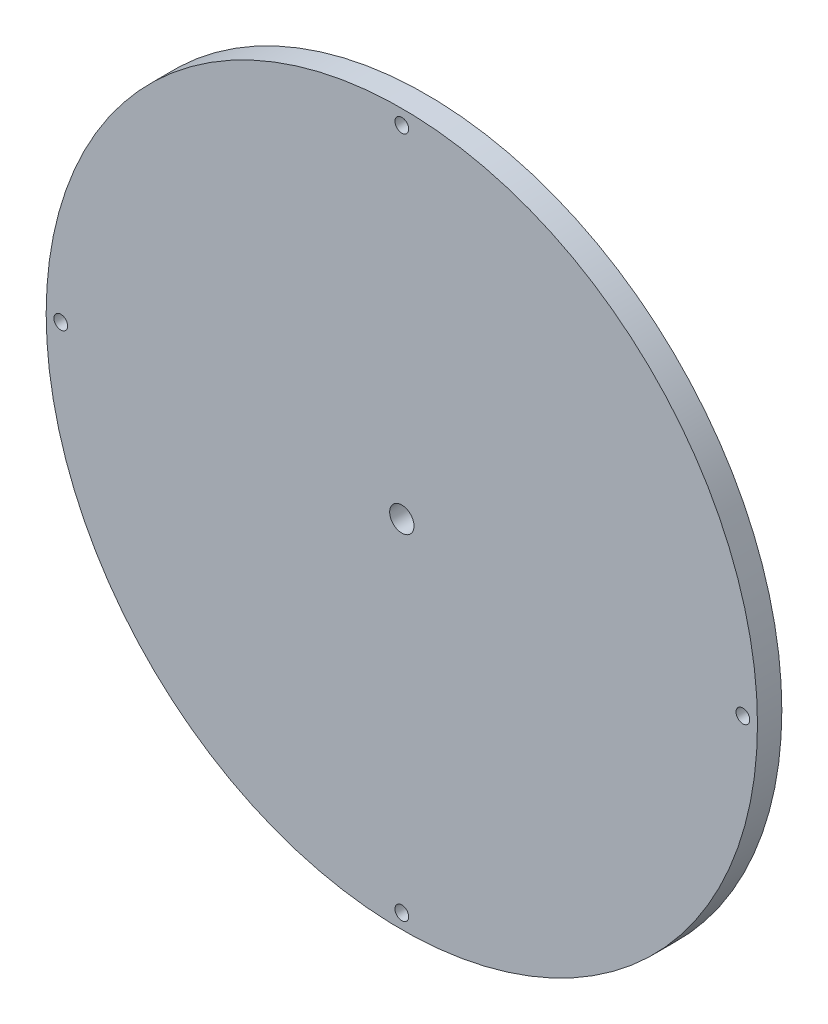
ISO-10303-21;
HEADER;
FILE_DESCRIPTION(('STEP AP214'),'2;1');
FILE_NAME('part.step','',(''),(''),'','','');
FILE_SCHEMA(('AUTOMOTIVE_DESIGN { 1 0 10303 214 1 1 1 1 }'));
ENDSEC;
DATA;
#1=APPLICATION_CONTEXT('core data for automotive mechanical design processes');
#2=APPLICATION_PROTOCOL_DEFINITION('international standard','automotive_design',2000,#1);
#3=PRODUCT_CONTEXT('',#1,'mechanical');
#4=PRODUCT('Part','Part','',(#3));
#5=PRODUCT_RELATED_PRODUCT_CATEGORY('part','',(#4));
#6=PRODUCT_DEFINITION_FORMATION('','',#4);
#7=PRODUCT_DEFINITION_CONTEXT('part definition',#1,'design');
#8=PRODUCT_DEFINITION('design','',#6,#7);
#9=PRODUCT_DEFINITION_SHAPE('','',#8);
#10=(LENGTH_UNIT() NAMED_UNIT(*) SI_UNIT(.MILLI.,.METRE.));
#11=(NAMED_UNIT(*) PLANE_ANGLE_UNIT() SI_UNIT($,.RADIAN.));
#12=(NAMED_UNIT(*) SI_UNIT($,.STERADIAN.) SOLID_ANGLE_UNIT());
#13=UNCERTAINTY_MEASURE_WITH_UNIT(LENGTH_MEASURE(1.E-05),#10,'distance_accuracy_value','');
#14=(GEOMETRIC_REPRESENTATION_CONTEXT(3) GLOBAL_UNCERTAINTY_ASSIGNED_CONTEXT((#13)) GLOBAL_UNIT_ASSIGNED_CONTEXT((#10,
#11,#12)) REPRESENTATION_CONTEXT('',''));
#15=CARTESIAN_POINT('',(0.,0.,0.));
#16=DIRECTION('',(0.,0.,1.));
#17=DIRECTION('',(1.,0.,0.));
#18=AXIS2_PLACEMENT_3D('',#15,#16,#17);
#19=CARTESIAN_POINT('',(0.,0.,6.35));
#20=DIRECTION('',(0.,0.,-1.));
#21=DIRECTION('',(-1.,0.,0.));
#22=AXIS2_PLACEMENT_3D('',#19,#20,#21);
#23=CYLINDRICAL_SURFACE('',#22,3.175);
#24=CARTESIAN_POINT('',(0.,0.,6.35));
#25=DIRECTION('',(0.,0.,1.));
#26=DIRECTION('',(1.,0.,0.));
#27=AXIS2_PLACEMENT_3D('',#24,#25,#26);
#28=CIRCLE('',#27,3.175);
#29=CARTESIAN_POINT('',(3.175,0.,6.35));
#30=VERTEX_POINT('',#29);
#31=EDGE_CURVE('E42',#30,#30,#28,.T.);
#32=ORIENTED_EDGE('',*,*,#31,.T.);
#33=EDGE_LOOP('',(#32));
#34=FACE_BOUND('',#33,.T.);
#35=CARTESIAN_POINT('',(0.,0.,0.));
#36=DIRECTION('',(0.,0.,1.));
#37=DIRECTION('',(1.,0.,0.));
#38=AXIS2_PLACEMENT_3D('',#35,#36,#37);
#39=CIRCLE('',#38,3.175);
#40=CARTESIAN_POINT('',(3.175,0.,0.));
#41=VERTEX_POINT('',#40);
#42=EDGE_CURVE('E62',#41,#41,#39,.T.);
#43=ORIENTED_EDGE('',*,*,#42,.F.);
#44=EDGE_LOOP('',(#43));
#45=FACE_BOUND('',#44,.T.);
#46=ADVANCED_FACE('F34',(#34,#45),#23,.F.);
#47=CARTESIAN_POINT('',(0.,88.9,6.35));
#48=DIRECTION('',(0.,0.,-1.));
#49=DIRECTION('',(-1.,0.,0.));
#50=AXIS2_PLACEMENT_3D('',#47,#48,#49);
#51=CYLINDRICAL_SURFACE('',#50,1.78593750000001);
#52=CARTESIAN_POINT('',(0.,88.9,6.35));
#53=DIRECTION('',(0.,0.,1.));
#54=DIRECTION('',(1.,0.,0.));
#55=AXIS2_PLACEMENT_3D('',#52,#53,#54);
#56=CIRCLE('',#55,1.78593750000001);
#57=CARTESIAN_POINT('',(1.78593750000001,88.9,6.35));
#58=VERTEX_POINT('',#57);
#59=EDGE_CURVE('E47',#58,#58,#56,.T.);
#60=ORIENTED_EDGE('',*,*,#59,.T.);
#61=EDGE_LOOP('',(#60));
#62=FACE_BOUND('',#61,.T.);
#63=CARTESIAN_POINT('',(0.,88.9,0.));
#64=DIRECTION('',(0.,0.,1.));
#65=DIRECTION('',(1.,0.,0.));
#66=AXIS2_PLACEMENT_3D('',#63,#64,#65);
#67=CIRCLE('',#66,1.78593750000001);
#68=CARTESIAN_POINT('',(1.78593750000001,88.9,0.));
#69=VERTEX_POINT('',#68);
#70=EDGE_CURVE('E60',#69,#69,#67,.T.);
#71=ORIENTED_EDGE('',*,*,#70,.F.);
#72=EDGE_LOOP('',(#71));
#73=FACE_BOUND('',#72,.T.);
#74=ADVANCED_FACE('F83',(#62,#73),#51,.F.);
#75=CARTESIAN_POINT('',(88.9,2.48711469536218E-12,6.35));
#76=DIRECTION('',(0.,0.,-1.));
#77=DIRECTION('',(-1.,0.,0.));
#78=AXIS2_PLACEMENT_3D('',#75,#76,#77);
#79=CYLINDRICAL_SURFACE('',#78,1.78593750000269);
#80=CARTESIAN_POINT('',(88.9,2.48711469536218E-12,6.35));
#81=DIRECTION('',(0.,0.,1.));
#82=DIRECTION('',(1.,0.,0.));
#83=AXIS2_PLACEMENT_3D('',#80,#81,#82);
#84=CIRCLE('',#83,1.78593750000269);
#85=CARTESIAN_POINT('',(90.6859375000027,2.48711469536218E-12,6.35));
#86=VERTEX_POINT('',#85);
#87=EDGE_CURVE('E76',#86,#86,#84,.T.);
#88=ORIENTED_EDGE('',*,*,#87,.T.);
#89=EDGE_LOOP('',(#88));
#90=FACE_BOUND('',#89,.T.);
#91=CARTESIAN_POINT('',(88.9,2.48711469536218E-12,0.));
#92=DIRECTION('',(0.,0.,1.));
#93=DIRECTION('',(1.,0.,0.));
#94=AXIS2_PLACEMENT_3D('',#91,#92,#93);
#95=CIRCLE('',#94,1.78593750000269);
#96=CARTESIAN_POINT('',(90.6859375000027,2.48711469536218E-12,0.));
#97=VERTEX_POINT('',#96);
#98=EDGE_CURVE('E57',#97,#97,#95,.T.);
#99=ORIENTED_EDGE('',*,*,#98,.F.);
#100=EDGE_LOOP('',(#99));
#101=FACE_BOUND('',#100,.T.);
#102=ADVANCED_FACE('F101',(#90,#101),#79,.F.);
#103=CARTESIAN_POINT('',(2.52770719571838E-12,-88.8999999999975,6.35));
#104=DIRECTION('',(0.,0.,-1.));
#105=DIRECTION('',(-1.,0.,0.));
#106=AXIS2_PLACEMENT_3D('',#103,#104,#105);
#107=CYLINDRICAL_SURFACE('',#106,1.78593750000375);
#108=CARTESIAN_POINT('',(2.52770719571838E-12,-88.8999999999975,6.35));
#109=DIRECTION('',(0.,0.,1.));
#110=DIRECTION('',(1.,0.,0.));
#111=AXIS2_PLACEMENT_3D('',#108,#109,#110);
#112=CIRCLE('',#111,1.78593750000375);
#113=CARTESIAN_POINT('',(1.78593750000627,-88.8999999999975,6.35));
#114=VERTEX_POINT('',#113);
#115=EDGE_CURVE('E71',#114,#114,#112,.T.);
#116=ORIENTED_EDGE('',*,*,#115,.T.);
#117=EDGE_LOOP('',(#116));
#118=FACE_BOUND('',#117,.T.);
#119=CARTESIAN_POINT('',(2.52770719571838E-12,-88.8999999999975,0.));
#120=DIRECTION('',(0.,0.,1.));
#121=DIRECTION('',(1.,0.,0.));
#122=AXIS2_PLACEMENT_3D('',#119,#120,#121);
#123=CIRCLE('',#122,1.78593750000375);
#124=CARTESIAN_POINT('',(1.78593750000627,-88.8999999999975,0.));
#125=VERTEX_POINT('',#124);
#126=EDGE_CURVE('E54',#125,#125,#123,.T.);
#127=ORIENTED_EDGE('',*,*,#126,.F.);
#128=EDGE_LOOP('',(#127));
#129=FACE_BOUND('',#128,.T.);
#130=ADVANCED_FACE('F107',(#118,#129),#107,.F.);
#131=CARTESIAN_POINT('',(-88.8999999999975,0.,6.35));
#132=DIRECTION('',(0.,0.,-1.));
#133=DIRECTION('',(-1.,0.,0.));
#134=AXIS2_PLACEMENT_3D('',#131,#132,#133);
#135=CYLINDRICAL_SURFACE('',#134,1.78593750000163);
#136=CARTESIAN_POINT('',(-88.8999999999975,0.,6.35));
#137=DIRECTION('',(0.,0.,1.));
#138=DIRECTION('',(1.,0.,0.));
#139=AXIS2_PLACEMENT_3D('',#136,#137,#138);
#140=CIRCLE('',#139,1.78593750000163);
#141=CARTESIAN_POINT('',(-87.1140624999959,0.,6.35));
#142=VERTEX_POINT('',#141);
#143=EDGE_CURVE('E67',#142,#142,#140,.T.);
#144=ORIENTED_EDGE('',*,*,#143,.T.);
#145=EDGE_LOOP('',(#144));
#146=FACE_BOUND('',#145,.T.);
#147=CARTESIAN_POINT('',(-88.8999999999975,0.,0.));
#148=DIRECTION('',(0.,0.,1.));
#149=DIRECTION('',(1.,0.,0.));
#150=AXIS2_PLACEMENT_3D('',#147,#148,#149);
#151=CIRCLE('',#150,1.78593750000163);
#152=CARTESIAN_POINT('',(-87.1140624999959,0.,0.));
#153=VERTEX_POINT('',#152);
#154=EDGE_CURVE('E51',#153,#153,#151,.T.);
#155=ORIENTED_EDGE('',*,*,#154,.F.);
#156=EDGE_LOOP('',(#155));
#157=FACE_BOUND('',#156,.T.);
#158=ADVANCED_FACE('F36',(#146,#157),#135,.F.);
#159=CARTESIAN_POINT('',(0.,0.,6.35));
#160=DIRECTION('',(0.,0.,-1.));
#161=DIRECTION('',(-1.,0.,0.));
#162=AXIS2_PLACEMENT_3D('',#159,#160,#161);
#163=CYLINDRICAL_SURFACE('',#162,92.71);
#164=CARTESIAN_POINT('',(0.,0.,6.35));
#165=DIRECTION('',(0.,0.,1.));
#166=DIRECTION('',(1.,0.,0.));
#167=AXIS2_PLACEMENT_3D('',#164,#165,#166);
#168=CIRCLE('',#167,92.71);
#169=CARTESIAN_POINT('',(92.71,0.,6.35));
#170=VERTEX_POINT('',#169);
#171=EDGE_CURVE('E10',#170,#170,#168,.T.);
#172=ORIENTED_EDGE('',*,*,#171,.F.);
#173=EDGE_LOOP('',(#172));
#174=FACE_BOUND('',#173,.T.);
#175=CARTESIAN_POINT('',(0.,0.,0.));
#176=DIRECTION('',(0.,0.,1.));
#177=DIRECTION('',(1.,0.,0.));
#178=AXIS2_PLACEMENT_3D('',#175,#176,#177);
#179=CIRCLE('',#178,92.71);
#180=CARTESIAN_POINT('',(92.71,0.,0.));
#181=VERTEX_POINT('',#180);
#182=EDGE_CURVE('E38',#181,#181,#179,.T.);
#183=ORIENTED_EDGE('',*,*,#182,.T.);
#184=EDGE_LOOP('',(#183));
#185=FACE_BOUND('',#184,.T.);
#186=ADVANCED_FACE('F90',(#174,#185),#163,.T.);
#187=CARTESIAN_POINT('',(0.,0.,6.35));
#188=DIRECTION('',(0.,0.,1.));
#189=DIRECTION('',(1.,0.,0.));
#190=AXIS2_PLACEMENT_3D('',#187,#188,#189);
#191=PLANE('',#190);
#192=ORIENTED_EDGE('',*,*,#143,.F.);
#193=EDGE_LOOP('',(#192));
#194=FACE_BOUND('',#193,.T.);
#195=ORIENTED_EDGE('',*,*,#115,.F.);
#196=EDGE_LOOP('',(#195));
#197=FACE_BOUND('',#196,.T.);
#198=ORIENTED_EDGE('',*,*,#87,.F.);
#199=EDGE_LOOP('',(#198));
#200=FACE_BOUND('',#199,.T.);
#201=ORIENTED_EDGE('',*,*,#59,.F.);
#202=EDGE_LOOP('',(#201));
#203=FACE_BOUND('',#202,.T.);
#204=ORIENTED_EDGE('',*,*,#31,.F.);
#205=EDGE_LOOP('',(#204));
#206=FACE_BOUND('',#205,.T.);
#207=ORIENTED_EDGE('',*,*,#171,.T.);
#208=EDGE_LOOP('',(#207));
#209=FACE_BOUND('',#208,.T.);
#210=ADVANCED_FACE('F86',(#194,#197,#200,#203,#206,#209),#191,.T.);
#211=CARTESIAN_POINT('',(0.,0.,0.));
#212=DIRECTION('',(0.,0.,1.));
#213=DIRECTION('',(1.,0.,0.));
#214=AXIS2_PLACEMENT_3D('',#211,#212,#213);
#215=PLANE('',#214);
#216=ORIENTED_EDGE('',*,*,#154,.T.);
#217=EDGE_LOOP('',(#216));
#218=FACE_BOUND('',#217,.T.);
#219=ORIENTED_EDGE('',*,*,#126,.T.);
#220=EDGE_LOOP('',(#219));
#221=FACE_BOUND('',#220,.T.);
#222=ORIENTED_EDGE('',*,*,#98,.T.);
#223=EDGE_LOOP('',(#222));
#224=FACE_BOUND('',#223,.T.);
#225=ORIENTED_EDGE('',*,*,#70,.T.);
#226=EDGE_LOOP('',(#225));
#227=FACE_BOUND('',#226,.T.);
#228=ORIENTED_EDGE('',*,*,#42,.T.);
#229=EDGE_LOOP('',(#228));
#230=FACE_BOUND('',#229,.T.);
#231=ORIENTED_EDGE('',*,*,#182,.F.);
#232=EDGE_LOOP('',(#231));
#233=FACE_BOUND('',#232,.T.);
#234=ADVANCED_FACE('F89',(#218,#221,#224,#227,#230,#233),#215,.F.);
#235=CLOSED_SHELL('',(#46,#74,#102,#130,#158,#186,#210,#234));
#236=MANIFOLD_SOLID_BREP('B2',#235);
#237=ADVANCED_BREP_SHAPE_REPRESENTATION('',(#18,#236),#14);
#238=SHAPE_DEFINITION_REPRESENTATION(#9,#237);
ENDSEC;
END-ISO-10303-21;
